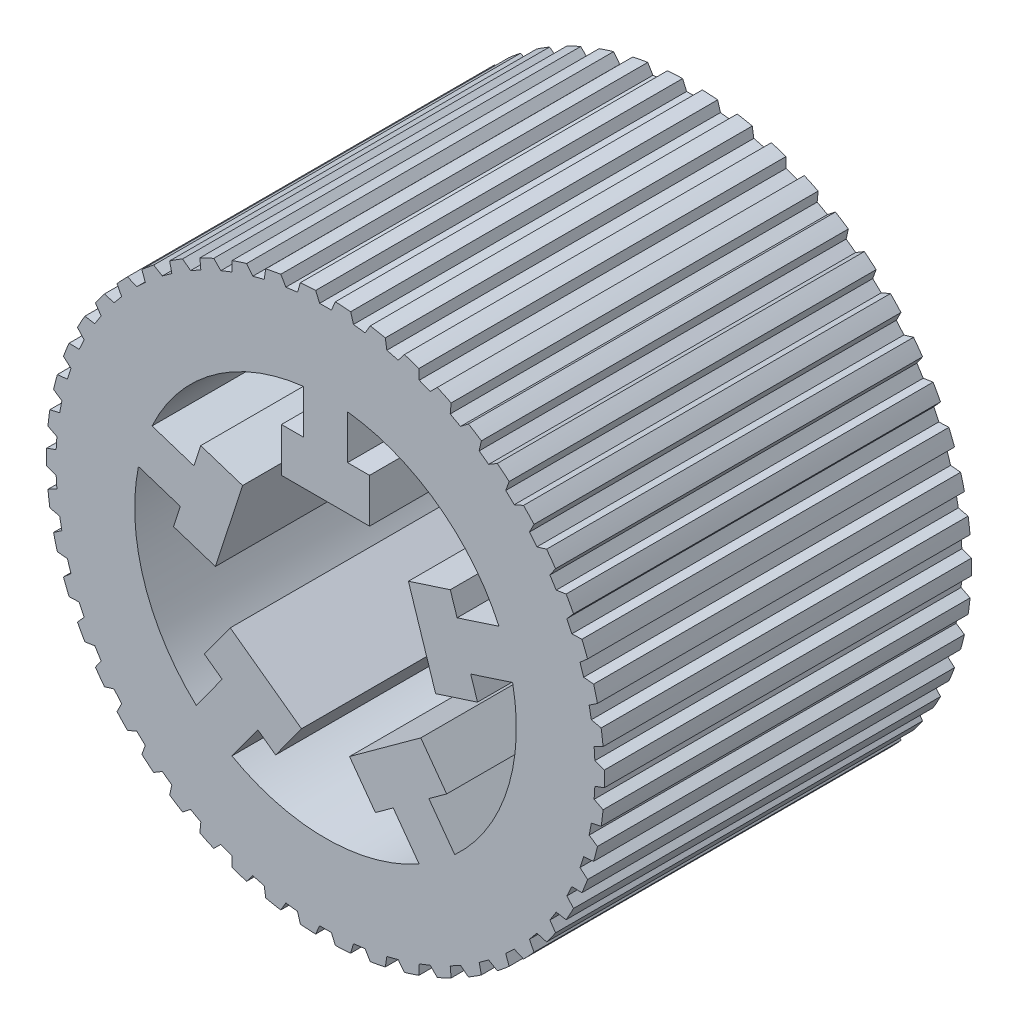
from build123d import *

# Parameters (mm, degrees)
SKETCH1_R           = 19
SKETCH1_R_2         = 13
BOSS_EXTRUDE1_DEPTH = 25
BOSS_EXTRUDE2_START = -25
BOSS_EXTRUDE2_DEPTH = 25
CIRPATTERN1_COUNT   = 5
CUT_EXTRUDE1_DEPTH  = 37.701498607
CIRPATTERN2_COUNT   = 50


with BuildPart() as part:
    # Sketch1 → Boss-Extrude1 (new body)
    with BuildSketch(Plane.XY):
        Circle(SKETCH1_R)
        Circle(SKETCH1_R_2, mode=Mode.SUBTRACT)
    extrude(amount=BOSS_EXTRUDE1_DEPTH)

    # Sketch2 → Boss-Extrude2 (add)
    with BuildSketch(Plane.XY.offset(25).offset(BOSS_EXTRUDE2_START)):
        with BuildLine():
            Line((-1.5, 12.91317157), (-1.5, 9.91317157))
            Line((-1.5, 9.91317157), (-3, 9.91317157))
            Line((-3, 9.91317157), (-3, 6.91317157))
            Line((-3, 6.91317157), (3, 6.91317157))
            Line((3, 6.91317157), (3, 9.91317157))
            Line((3, 9.91317157), (1.5, 9.91317157))
            Line((1.5, 9.91317157), (1.5, 12.91317157))
            ThreePointArc((1.5, 12.91317157), (0, 13), (-1.5, 12.91317157))
        make_face()
    boss_extrude2 = extrude(amount=BOSS_EXTRUDE2_DEPTH)

    # CirPattern1: Boss-Extrude2 ×5 about axis
    cirpattern1_axis = Axis((0, 0, 0), (0, 0, 1))
    for i in range(1, CIRPATTERN1_COUNT):
        add(boss_extrude2.rotate(cirpattern1_axis, i * 360 / CIRPATTERN1_COUNT))

    # Sketch4 → Cut-Extrude1 (cut, symmetric)
    with BuildSketch(Plane.XY.offset(25)):
        with BuildLine():
            Line((0, 18.359949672), (0, 19))
            ThreePointArc((0, 19), (-0.335872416, 18.997031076), (-0.671639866, 18.988125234))
            Line((-0.671639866, 18.988125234), (-0.400254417, 18.359949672))
            Line((-0.400254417, 18.359949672), (0, 18.359949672))
        make_face()
        with BuildLine():
            ThreePointArc((0.671639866, 18.988125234), (0.335872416, 18.997031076), (0, 19))
            Line((0, 19), (0, 18.359949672))
            Line((0, 18.359949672), (0.400254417, 18.359949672))
            Line((0.400254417, 18.359949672), (0.671639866, 18.988125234))
        make_face()
    cut_extrude1 = extrude(amount=CUT_EXTRUDE1_DEPTH, both=True, mode=Mode.SUBTRACT)

    # CirPattern2: Cut-Extrude1 ×50 about axis
    cirpattern2_axis = Axis((0, 0, 0), (0, 0, 1))
    for i in range(1, CIRPATTERN2_COUNT):
        add(cut_extrude1.rotate(cirpattern2_axis, i * 360 / CIRPATTERN2_COUNT), mode=Mode.SUBTRACT)


solid = part.part
